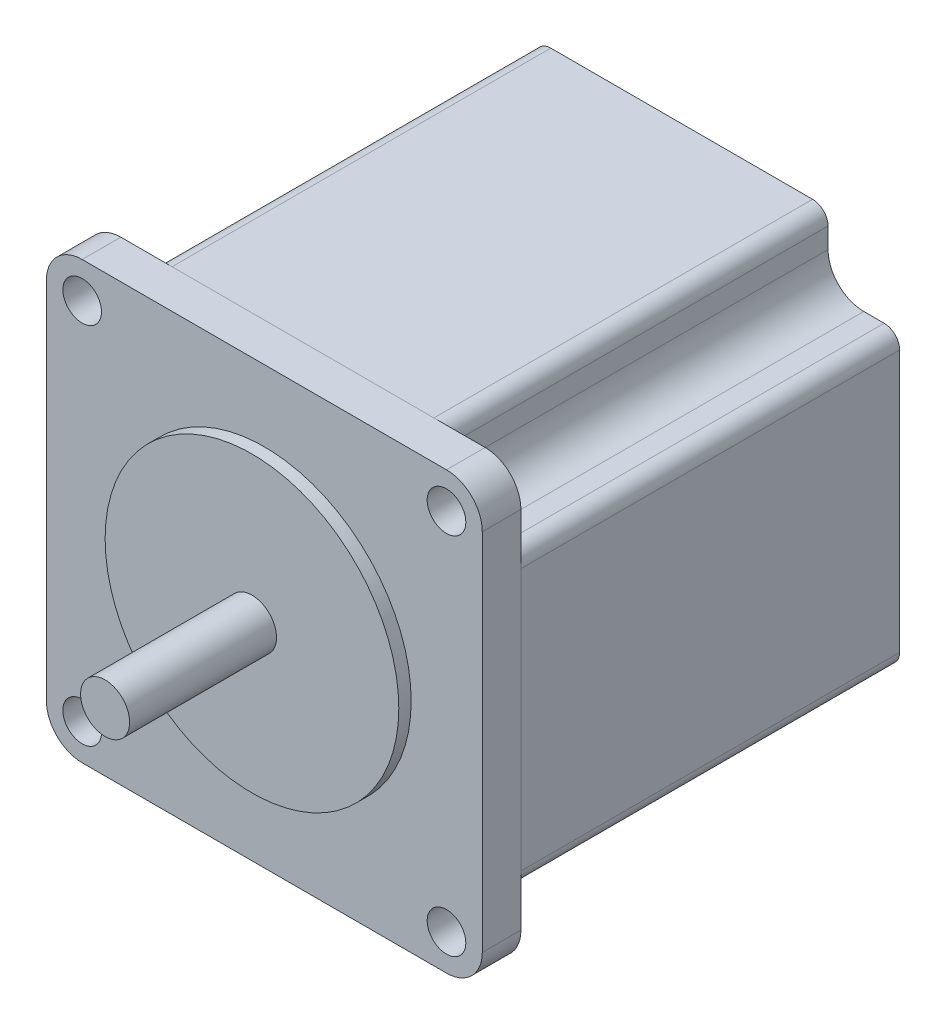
ISO-10303-21;
HEADER;
FILE_DESCRIPTION(('STEP AP214'),'2;1');
FILE_NAME('part.step','',(''),(''),'','','');
FILE_SCHEMA(('AUTOMOTIVE_DESIGN { 1 0 10303 214 1 1 1 1 }'));
ENDSEC;
DATA;
#1=APPLICATION_CONTEXT('core data for automotive mechanical design processes');
#2=APPLICATION_PROTOCOL_DEFINITION('international standard','automotive_design',2000,#1);
#3=PRODUCT_CONTEXT('',#1,'mechanical');
#4=PRODUCT('Part','Part','',(#3));
#5=PRODUCT_RELATED_PRODUCT_CATEGORY('part','',(#4));
#6=PRODUCT_DEFINITION_FORMATION('','',#4);
#7=PRODUCT_DEFINITION_CONTEXT('part definition',#1,'design');
#8=PRODUCT_DEFINITION('design','',#6,#7);
#9=PRODUCT_DEFINITION_SHAPE('','',#8);
#10=(LENGTH_UNIT() NAMED_UNIT(*) SI_UNIT(.MILLI.,.METRE.));
#11=(NAMED_UNIT(*) PLANE_ANGLE_UNIT() SI_UNIT($,.RADIAN.));
#12=(NAMED_UNIT(*) SI_UNIT($,.STERADIAN.) SOLID_ANGLE_UNIT());
#13=UNCERTAINTY_MEASURE_WITH_UNIT(LENGTH_MEASURE(1.E-05),#10,'distance_accuracy_value','');
#14=(GEOMETRIC_REPRESENTATION_CONTEXT(3) GLOBAL_UNCERTAINTY_ASSIGNED_CONTEXT((#13)) GLOBAL_UNIT_ASSIGNED_CONTEXT((#10,
#11,#12)) REPRESENTATION_CONTEXT('',''));
#15=CARTESIAN_POINT('',(0.,0.,0.));
#16=DIRECTION('',(0.,0.,1.));
#17=DIRECTION('',(1.,0.,0.));
#18=AXIS2_PLACEMENT_3D('',#15,#16,#17);
#19=CARTESIAN_POINT('',(26.2,-16.94,-54.));
#20=DIRECTION('',(0.,0.,1.));
#21=DIRECTION('',(1.,0.,0.));
#22=AXIS2_PLACEMENT_3D('',#19,#20,#21);
#23=CYLINDRICAL_SURFACE('',#22,2.);
#24=CARTESIAN_POINT('',(26.2,-16.94,-5.));
#25=DIRECTION('',(0.,0.,-1.));
#26=DIRECTION('',(-1.,0.,0.));
#27=AXIS2_PLACEMENT_3D('',#24,#25,#26);
#28=CIRCLE('',#27,2.);
#29=CARTESIAN_POINT('',(28.2,-16.94,-5.));
#30=VERTEX_POINT('',#29);
#31=CARTESIAN_POINT('',(26.2,-18.94,-5.));
#32=VERTEX_POINT('',#31);
#33=EDGE_CURVE('E238',#30,#32,#28,.T.);
#34=ORIENTED_EDGE('',*,*,#33,.T.);
#35=DIRECTION('',(0.,0.,1.));
#36=VECTOR('',#35,1.);
#37=CARTESIAN_POINT('',(26.2,-18.94,-54.));
#38=LINE('',#37,#36);
#39=CARTESIAN_POINT('',(26.2,-18.94,-54.));
#40=VERTEX_POINT('',#39);
#41=EDGE_CURVE('E12',#40,#32,#38,.T.);
#42=ORIENTED_EDGE('',*,*,#41,.F.);
#43=CARTESIAN_POINT('',(26.2,-16.94,-54.));
#44=DIRECTION('',(0.,0.,-1.));
#45=DIRECTION('',(-1.,0.,0.));
#46=AXIS2_PLACEMENT_3D('',#43,#44,#45);
#47=CIRCLE('',#46,2.);
#48=CARTESIAN_POINT('',(28.2,-16.94,-54.));
#49=VERTEX_POINT('',#48);
#50=EDGE_CURVE('E284',#49,#40,#47,.T.);
#51=ORIENTED_EDGE('',*,*,#50,.F.);
#52=DIRECTION('',(0.,0.,1.));
#53=VECTOR('',#52,1.);
#54=CARTESIAN_POINT('',(28.2,-16.94,-54.));
#55=LINE('',#54,#53);
#56=EDGE_CURVE('E234',#49,#30,#55,.T.);
#57=ORIENTED_EDGE('',*,*,#56,.T.);
#58=EDGE_LOOP('',(#34,#42,#51,#57));
#59=FACE_BOUND('',#58,.T.);
#60=ADVANCED_FACE('F46',(#59),#23,.T.);
#61=CARTESIAN_POINT('',(26.2,-18.94,-54.));
#62=DIRECTION('',(0.,1.,0.));
#63=DIRECTION('',(-1.,0.,0.));
#64=AXIS2_PLACEMENT_3D('',#61,#62,#63);
#65=PLANE('',#64);
#66=DIRECTION('',(-1.,0.,0.));
#67=VECTOR('',#66,1.);
#68=CARTESIAN_POINT('',(26.2,-18.94,-5.));
#69=LINE('',#68,#67);
#70=CARTESIAN_POINT('',(23.57,-18.94,-5.));
#71=VERTEX_POINT('',#70);
#72=EDGE_CURVE('E241',#32,#71,#69,.T.);
#73=ORIENTED_EDGE('',*,*,#72,.T.);
#74=DIRECTION('',(0.,0.,1.));
#75=VECTOR('',#74,1.);
#76=CARTESIAN_POINT('',(23.57,-18.94,-54.));
#77=LINE('',#76,#75);
#78=CARTESIAN_POINT('',(23.57,-18.94,-54.));
#79=VERTEX_POINT('',#78);
#80=EDGE_CURVE('E54',#79,#71,#77,.T.);
#81=ORIENTED_EDGE('',*,*,#80,.F.);
#82=DIRECTION('',(-1.,0.,0.));
#83=VECTOR('',#82,1.);
#84=CARTESIAN_POINT('',(26.2,-18.94,-54.));
#85=LINE('',#84,#83);
#86=EDGE_CURVE('E153',#40,#79,#85,.T.);
#87=ORIENTED_EDGE('',*,*,#86,.F.);
#88=ORIENTED_EDGE('',*,*,#41,.T.);
#89=EDGE_LOOP('',(#73,#81,#87,#88));
#90=FACE_BOUND('',#89,.T.);
#91=ADVANCED_FACE('F422',(#90),#65,.F.);
#92=CARTESIAN_POINT('',(23.57,-23.57,-54.));
#93=DIRECTION('',(0.,0.,1.));
#94=DIRECTION('',(1.,0.,0.));
#95=AXIS2_PLACEMENT_3D('',#92,#93,#94);
#96=CYLINDRICAL_SURFACE('',#95,4.62999999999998);
#97=CARTESIAN_POINT('',(23.57,-23.57,-5.));
#98=DIRECTION('',(0.,0.,1.));
#99=DIRECTION('',(-1.,0.,0.));
#100=AXIS2_PLACEMENT_3D('',#97,#98,#99);
#101=CIRCLE('',#100,4.62999999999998);
#102=CARTESIAN_POINT('',(18.94,-23.57,-5.));
#103=VERTEX_POINT('',#102);
#104=EDGE_CURVE('E243',#71,#103,#101,.T.);
#105=ORIENTED_EDGE('',*,*,#104,.T.);
#106=DIRECTION('',(0.,0.,1.));
#107=VECTOR('',#106,1.);
#108=CARTESIAN_POINT('',(18.94,-23.57,-54.));
#109=LINE('',#108,#107);
#110=CARTESIAN_POINT('',(18.94,-23.57,-54.));
#111=VERTEX_POINT('',#110);
#112=EDGE_CURVE('E339',#111,#103,#109,.T.);
#113=ORIENTED_EDGE('',*,*,#112,.F.);
#114=CARTESIAN_POINT('',(23.57,-23.57,-54.));
#115=DIRECTION('',(0.,0.,1.));
#116=DIRECTION('',(-1.,0.,0.));
#117=AXIS2_PLACEMENT_3D('',#114,#115,#116);
#118=CIRCLE('',#117,4.62999999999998);
#119=EDGE_CURVE('E347',#79,#111,#118,.T.);
#120=ORIENTED_EDGE('',*,*,#119,.F.);
#121=ORIENTED_EDGE('',*,*,#80,.T.);
#122=EDGE_LOOP('',(#105,#113,#120,#121));
#123=FACE_BOUND('',#122,.T.);
#124=ADVANCED_FACE('F345',(#123),#96,.F.);
#125=CARTESIAN_POINT('',(18.94,-23.57,-54.));
#126=DIRECTION('',(-1.,0.,0.));
#127=DIRECTION('',(0.,-1.,0.));
#128=AXIS2_PLACEMENT_3D('',#125,#126,#127);
#129=PLANE('',#128);
#130=DIRECTION('',(0.,-1.,0.));
#131=VECTOR('',#130,1.);
#132=CARTESIAN_POINT('',(18.94,-23.57,-5.));
#133=LINE('',#132,#131);
#134=CARTESIAN_POINT('',(18.94,-26.2,-5.));
#135=VERTEX_POINT('',#134);
#136=EDGE_CURVE('E245',#103,#135,#133,.T.);
#137=ORIENTED_EDGE('',*,*,#136,.T.);
#138=DIRECTION('',(0.,0.,1.));
#139=VECTOR('',#138,1.);
#140=CARTESIAN_POINT('',(18.94,-26.2,-54.));
#141=LINE('',#140,#139);
#142=CARTESIAN_POINT('',(18.94,-26.2,-54.));
#143=VERTEX_POINT('',#142);
#144=EDGE_CURVE('E336',#143,#135,#141,.T.);
#145=ORIENTED_EDGE('',*,*,#144,.F.);
#146=DIRECTION('',(0.,-1.,0.));
#147=VECTOR('',#146,1.);
#148=CARTESIAN_POINT('',(18.94,-23.57,-54.));
#149=LINE('',#148,#147);
#150=EDGE_CURVE('E365',#111,#143,#149,.T.);
#151=ORIENTED_EDGE('',*,*,#150,.F.);
#152=ORIENTED_EDGE('',*,*,#112,.T.);
#153=EDGE_LOOP('',(#137,#145,#151,#152));
#154=FACE_BOUND('',#153,.T.);
#155=ADVANCED_FACE('F356',(#154),#129,.F.);
#156=CARTESIAN_POINT('',(16.94,-26.2,-54.));
#157=DIRECTION('',(0.,0.,1.));
#158=DIRECTION('',(1.,0.,0.));
#159=AXIS2_PLACEMENT_3D('',#156,#157,#158);
#160=CYLINDRICAL_SURFACE('',#159,2.);
#161=CARTESIAN_POINT('',(16.94,-26.2,-5.));
#162=DIRECTION('',(0.,0.,-1.));
#163=DIRECTION('',(-1.,0.,0.));
#164=AXIS2_PLACEMENT_3D('',#161,#162,#163);
#165=CIRCLE('',#164,2.);
#166=CARTESIAN_POINT('',(16.94,-28.2,-5.));
#167=VERTEX_POINT('',#166);
#168=EDGE_CURVE('E247',#135,#167,#165,.T.);
#169=ORIENTED_EDGE('',*,*,#168,.T.);
#170=DIRECTION('',(0.,0.,1.));
#171=VECTOR('',#170,1.);
#172=CARTESIAN_POINT('',(16.94,-28.2,-54.));
#173=LINE('',#172,#171);
#174=CARTESIAN_POINT('',(16.94,-28.2,-54.));
#175=VERTEX_POINT('',#174);
#176=EDGE_CURVE('E333',#175,#167,#173,.T.);
#177=ORIENTED_EDGE('',*,*,#176,.F.);
#178=CARTESIAN_POINT('',(16.94,-26.2,-54.));
#179=DIRECTION('',(0.,0.,-1.));
#180=DIRECTION('',(-1.,0.,0.));
#181=AXIS2_PLACEMENT_3D('',#178,#179,#180);
#182=CIRCLE('',#181,2.);
#183=EDGE_CURVE('E362',#143,#175,#182,.T.);
#184=ORIENTED_EDGE('',*,*,#183,.F.);
#185=ORIENTED_EDGE('',*,*,#144,.T.);
#186=EDGE_LOOP('',(#169,#177,#184,#185));
#187=FACE_BOUND('',#186,.T.);
#188=ADVANCED_FACE('F360',(#187),#160,.T.);
#189=CARTESIAN_POINT('',(-16.94,-28.2,-54.));
#190=DIRECTION('',(0.,1.,0.));
#191=DIRECTION('',(-1.,0.,0.));
#192=AXIS2_PLACEMENT_3D('',#189,#190,#191);
#193=PLANE('',#192);
#194=DIRECTION('',(-1.,0.,0.));
#195=VECTOR('',#194,1.);
#196=CARTESIAN_POINT('',(-16.94,-28.2,-5.));
#197=LINE('',#196,#195);
#198=CARTESIAN_POINT('',(-16.94,-28.2,-5.));
#199=VERTEX_POINT('',#198);
#200=EDGE_CURVE('E249',#167,#199,#197,.T.);
#201=ORIENTED_EDGE('',*,*,#200,.T.);
#202=DIRECTION('',(0.,0.,1.));
#203=VECTOR('',#202,1.);
#204=CARTESIAN_POINT('',(-16.94,-28.2,-54.));
#205=LINE('',#204,#203);
#206=CARTESIAN_POINT('',(-16.94,-28.2,-54.));
#207=VERTEX_POINT('',#206);
#208=EDGE_CURVE('E330',#207,#199,#205,.T.);
#209=ORIENTED_EDGE('',*,*,#208,.F.);
#210=DIRECTION('',(-1.,0.,0.));
#211=VECTOR('',#210,1.);
#212=CARTESIAN_POINT('',(-16.94,-28.2,-54.));
#213=LINE('',#212,#211);
#214=EDGE_CURVE('E364',#175,#207,#213,.T.);
#215=ORIENTED_EDGE('',*,*,#214,.F.);
#216=ORIENTED_EDGE('',*,*,#176,.T.);
#217=EDGE_LOOP('',(#201,#209,#215,#216));
#218=FACE_BOUND('',#217,.T.);
#219=ADVANCED_FACE('F435',(#218),#193,.F.);
#220=CARTESIAN_POINT('',(-16.9400000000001,-26.2,-54.));
#221=DIRECTION('',(0.,0.,1.));
#222=DIRECTION('',(1.,0.,0.));
#223=AXIS2_PLACEMENT_3D('',#220,#221,#222);
#224=CYLINDRICAL_SURFACE('',#223,2.);
#225=CARTESIAN_POINT('',(-16.9400000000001,-26.2,-5.));
#226=DIRECTION('',(0.,0.,-1.));
#227=DIRECTION('',(-1.,0.,0.));
#228=AXIS2_PLACEMENT_3D('',#225,#226,#227);
#229=CIRCLE('',#228,2.);
#230=CARTESIAN_POINT('',(-18.9400000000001,-26.2,-5.));
#231=VERTEX_POINT('',#230);
#232=EDGE_CURVE('E251',#199,#231,#229,.T.);
#233=ORIENTED_EDGE('',*,*,#232,.T.);
#234=DIRECTION('',(0.,0.,1.));
#235=VECTOR('',#234,1.);
#236=CARTESIAN_POINT('',(-18.9400000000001,-26.2,-54.));
#237=LINE('',#236,#235);
#238=CARTESIAN_POINT('',(-18.9400000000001,-26.2,-54.));
#239=VERTEX_POINT('',#238);
#240=EDGE_CURVE('E327',#239,#231,#237,.T.);
#241=ORIENTED_EDGE('',*,*,#240,.F.);
#242=CARTESIAN_POINT('',(-16.9400000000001,-26.2,-54.));
#243=DIRECTION('',(0.,0.,-1.));
#244=DIRECTION('',(-1.,0.,0.));
#245=AXIS2_PLACEMENT_3D('',#242,#243,#244);
#246=CIRCLE('',#245,2.);
#247=EDGE_CURVE('E367',#207,#239,#246,.T.);
#248=ORIENTED_EDGE('',*,*,#247,.F.);
#249=ORIENTED_EDGE('',*,*,#208,.T.);
#250=EDGE_LOOP('',(#233,#241,#248,#249));
#251=FACE_BOUND('',#250,.T.);
#252=ADVANCED_FACE('F438',(#251),#224,.T.);
#253=CARTESIAN_POINT('',(-18.9400000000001,-23.57,-54.));
#254=DIRECTION('',(1.,0.,0.));
#255=DIRECTION('',(0.,1.,0.));
#256=AXIS2_PLACEMENT_3D('',#253,#254,#255);
#257=PLANE('',#256);
#258=DIRECTION('',(0.,1.,0.));
#259=VECTOR('',#258,1.);
#260=CARTESIAN_POINT('',(-18.9400000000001,-23.57,-5.));
#261=LINE('',#260,#259);
#262=CARTESIAN_POINT('',(-18.9400000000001,-23.57,-5.));
#263=VERTEX_POINT('',#262);
#264=EDGE_CURVE('E253',#231,#263,#261,.T.);
#265=ORIENTED_EDGE('',*,*,#264,.T.);
#266=DIRECTION('',(0.,0.,1.));
#267=VECTOR('',#266,1.);
#268=CARTESIAN_POINT('',(-18.9400000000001,-23.57,-54.));
#269=LINE('',#268,#267);
#270=CARTESIAN_POINT('',(-18.9400000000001,-23.57,-54.));
#271=VERTEX_POINT('',#270);
#272=EDGE_CURVE('E324',#271,#263,#269,.T.);
#273=ORIENTED_EDGE('',*,*,#272,.F.);
#274=DIRECTION('',(0.,1.,0.));
#275=VECTOR('',#274,1.);
#276=CARTESIAN_POINT('',(-18.9400000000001,-23.57,-54.));
#277=LINE('',#276,#275);
#278=EDGE_CURVE('E373',#239,#271,#277,.T.);
#279=ORIENTED_EDGE('',*,*,#278,.F.);
#280=ORIENTED_EDGE('',*,*,#240,.T.);
#281=EDGE_LOOP('',(#265,#273,#279,#280));
#282=FACE_BOUND('',#281,.T.);
#283=ADVANCED_FACE('F442',(#282),#257,.F.);
#284=CARTESIAN_POINT('',(-23.57,-23.57,-54.));
#285=DIRECTION('',(0.,0.,1.));
#286=DIRECTION('',(1.,0.,0.));
#287=AXIS2_PLACEMENT_3D('',#284,#285,#286);
#288=CYLINDRICAL_SURFACE('',#287,4.62999999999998);
#289=CARTESIAN_POINT('',(-23.57,-23.57,-5.));
#290=DIRECTION('',(0.,0.,1.));
#291=DIRECTION('',(-1.,0.,0.));
#292=AXIS2_PLACEMENT_3D('',#289,#290,#291);
#293=CIRCLE('',#292,4.62999999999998);
#294=CARTESIAN_POINT('',(-23.57,-18.94,-5.));
#295=VERTEX_POINT('',#294);
#296=EDGE_CURVE('E255',#263,#295,#293,.T.);
#297=ORIENTED_EDGE('',*,*,#296,.T.);
#298=DIRECTION('',(0.,0.,1.));
#299=VECTOR('',#298,1.);
#300=CARTESIAN_POINT('',(-23.57,-18.94,-54.));
#301=LINE('',#300,#299);
#302=CARTESIAN_POINT('',(-23.57,-18.94,-54.));
#303=VERTEX_POINT('',#302);
#304=EDGE_CURVE('E321',#303,#295,#301,.T.);
#305=ORIENTED_EDGE('',*,*,#304,.F.);
#306=CARTESIAN_POINT('',(-23.57,-23.57,-54.));
#307=DIRECTION('',(0.,0.,1.));
#308=DIRECTION('',(-1.,0.,0.));
#309=AXIS2_PLACEMENT_3D('',#306,#307,#308);
#310=CIRCLE('',#309,4.62999999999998);
#311=EDGE_CURVE('E375',#271,#303,#310,.T.);
#312=ORIENTED_EDGE('',*,*,#311,.F.);
#313=ORIENTED_EDGE('',*,*,#272,.T.);
#314=EDGE_LOOP('',(#297,#305,#312,#313));
#315=FACE_BOUND('',#314,.T.);
#316=ADVANCED_FACE('F446',(#315),#288,.F.);
#317=CARTESIAN_POINT('',(-23.57,-18.94,-54.));
#318=DIRECTION('',(0.,1.,0.));
#319=DIRECTION('',(-1.,0.,0.));
#320=AXIS2_PLACEMENT_3D('',#317,#318,#319);
#321=PLANE('',#320);
#322=DIRECTION('',(-1.,0.,0.));
#323=VECTOR('',#322,1.);
#324=CARTESIAN_POINT('',(-23.57,-18.94,-5.));
#325=LINE('',#324,#323);
#326=CARTESIAN_POINT('',(-26.2,-18.94,-5.));
#327=VERTEX_POINT('',#326);
#328=EDGE_CURVE('E257',#295,#327,#325,.T.);
#329=ORIENTED_EDGE('',*,*,#328,.T.);
#330=DIRECTION('',(0.,0.,1.));
#331=VECTOR('',#330,1.);
#332=CARTESIAN_POINT('',(-26.2,-18.94,-54.));
#333=LINE('',#332,#331);
#334=CARTESIAN_POINT('',(-26.2,-18.94,-54.));
#335=VERTEX_POINT('',#334);
#336=EDGE_CURVE('E318',#335,#327,#333,.T.);
#337=ORIENTED_EDGE('',*,*,#336,.F.);
#338=DIRECTION('',(-1.,0.,0.));
#339=VECTOR('',#338,1.);
#340=CARTESIAN_POINT('',(-23.57,-18.94,-54.));
#341=LINE('',#340,#339);
#342=EDGE_CURVE('E377',#303,#335,#341,.T.);
#343=ORIENTED_EDGE('',*,*,#342,.F.);
#344=ORIENTED_EDGE('',*,*,#304,.T.);
#345=EDGE_LOOP('',(#329,#337,#343,#344));
#346=FACE_BOUND('',#345,.T.);
#347=ADVANCED_FACE('F450',(#346),#321,.F.);
#348=CARTESIAN_POINT('',(-26.2,-16.94,-54.));
#349=DIRECTION('',(0.,0.,1.));
#350=DIRECTION('',(1.,0.,0.));
#351=AXIS2_PLACEMENT_3D('',#348,#349,#350);
#352=CYLINDRICAL_SURFACE('',#351,2.);
#353=CARTESIAN_POINT('',(-26.2,-16.94,-5.));
#354=DIRECTION('',(0.,0.,-1.));
#355=DIRECTION('',(1.,0.,0.));
#356=AXIS2_PLACEMENT_3D('',#353,#354,#355);
#357=CIRCLE('',#356,2.);
#358=CARTESIAN_POINT('',(-28.2,-16.94,-5.));
#359=VERTEX_POINT('',#358);
#360=EDGE_CURVE('E259',#327,#359,#357,.T.);
#361=ORIENTED_EDGE('',*,*,#360,.T.);
#362=DIRECTION('',(0.,0.,1.));
#363=VECTOR('',#362,1.);
#364=CARTESIAN_POINT('',(-28.2,-16.94,-54.));
#365=LINE('',#364,#363);
#366=CARTESIAN_POINT('',(-28.2,-16.94,-54.));
#367=VERTEX_POINT('',#366);
#368=EDGE_CURVE('E315',#367,#359,#365,.T.);
#369=ORIENTED_EDGE('',*,*,#368,.F.);
#370=CARTESIAN_POINT('',(-26.2,-16.94,-54.));
#371=DIRECTION('',(0.,0.,-1.));
#372=DIRECTION('',(1.,0.,0.));
#373=AXIS2_PLACEMENT_3D('',#370,#371,#372);
#374=CIRCLE('',#373,2.);
#375=EDGE_CURVE('E379',#335,#367,#374,.T.);
#376=ORIENTED_EDGE('',*,*,#375,.F.);
#377=ORIENTED_EDGE('',*,*,#336,.T.);
#378=EDGE_LOOP('',(#361,#369,#376,#377));
#379=FACE_BOUND('',#378,.T.);
#380=ADVANCED_FACE('F454',(#379),#352,.T.);
#381=CARTESIAN_POINT('',(-28.2,-16.94,-54.));
#382=DIRECTION('',(1.,0.,0.));
#383=DIRECTION('',(0.,1.,0.));
#384=AXIS2_PLACEMENT_3D('',#381,#382,#383);
#385=PLANE('',#384);
#386=DIRECTION('',(0.,1.,0.));
#387=VECTOR('',#386,1.);
#388=CARTESIAN_POINT('',(-28.2,-16.94,-5.));
#389=LINE('',#388,#387);
#390=CARTESIAN_POINT('',(-28.2,16.94,-5.));
#391=VERTEX_POINT('',#390);
#392=EDGE_CURVE('E261',#359,#391,#389,.T.);
#393=ORIENTED_EDGE('',*,*,#392,.T.);
#394=DIRECTION('',(0.,0.,1.));
#395=VECTOR('',#394,1.);
#396=CARTESIAN_POINT('',(-28.2,16.94,-54.));
#397=LINE('',#396,#395);
#398=CARTESIAN_POINT('',(-28.2,16.94,-54.));
#399=VERTEX_POINT('',#398);
#400=EDGE_CURVE('E312',#399,#391,#397,.T.);
#401=ORIENTED_EDGE('',*,*,#400,.F.);
#402=DIRECTION('',(0.,1.,0.));
#403=VECTOR('',#402,1.);
#404=CARTESIAN_POINT('',(-28.2,-16.94,-54.));
#405=LINE('',#404,#403);
#406=EDGE_CURVE('E381',#367,#399,#405,.T.);
#407=ORIENTED_EDGE('',*,*,#406,.F.);
#408=ORIENTED_EDGE('',*,*,#368,.T.);
#409=EDGE_LOOP('',(#393,#401,#407,#408));
#410=FACE_BOUND('',#409,.T.);
#411=ADVANCED_FACE('F458',(#410),#385,.F.);
#412=CARTESIAN_POINT('',(-26.2,16.94,-54.));
#413=DIRECTION('',(0.,0.,1.));
#414=DIRECTION('',(1.,0.,0.));
#415=AXIS2_PLACEMENT_3D('',#412,#413,#414);
#416=CYLINDRICAL_SURFACE('',#415,2.);
#417=CARTESIAN_POINT('',(-26.2,16.94,-5.));
#418=DIRECTION('',(0.,0.,-1.));
#419=DIRECTION('',(-1.,0.,0.));
#420=AXIS2_PLACEMENT_3D('',#417,#418,#419);
#421=CIRCLE('',#420,2.);
#422=CARTESIAN_POINT('',(-26.2,18.94,-5.));
#423=VERTEX_POINT('',#422);
#424=EDGE_CURVE('E263',#391,#423,#421,.T.);
#425=ORIENTED_EDGE('',*,*,#424,.T.);
#426=DIRECTION('',(0.,0.,1.));
#427=VECTOR('',#426,1.);
#428=CARTESIAN_POINT('',(-26.2,18.94,-54.));
#429=LINE('',#428,#427);
#430=CARTESIAN_POINT('',(-26.2,18.94,-54.));
#431=VERTEX_POINT('',#430);
#432=EDGE_CURVE('E309',#431,#423,#429,.T.);
#433=ORIENTED_EDGE('',*,*,#432,.F.);
#434=CARTESIAN_POINT('',(-26.2,16.94,-54.));
#435=DIRECTION('',(0.,0.,-1.));
#436=DIRECTION('',(-1.,0.,0.));
#437=AXIS2_PLACEMENT_3D('',#434,#435,#436);
#438=CIRCLE('',#437,2.);
#439=EDGE_CURVE('E383',#399,#431,#438,.T.);
#440=ORIENTED_EDGE('',*,*,#439,.F.);
#441=ORIENTED_EDGE('',*,*,#400,.T.);
#442=EDGE_LOOP('',(#425,#433,#440,#441));
#443=FACE_BOUND('',#442,.T.);
#444=ADVANCED_FACE('F462',(#443),#416,.T.);
#445=CARTESIAN_POINT('',(-26.2,18.94,-54.));
#446=DIRECTION('',(0.,-1.,0.));
#447=DIRECTION('',(1.,0.,0.));
#448=AXIS2_PLACEMENT_3D('',#445,#446,#447);
#449=PLANE('',#448);
#450=DIRECTION('',(1.,0.,0.));
#451=VECTOR('',#450,1.);
#452=CARTESIAN_POINT('',(-26.2,18.94,-5.));
#453=LINE('',#452,#451);
#454=CARTESIAN_POINT('',(-23.57,18.94,-5.));
#455=VERTEX_POINT('',#454);
#456=EDGE_CURVE('E265',#423,#455,#453,.T.);
#457=ORIENTED_EDGE('',*,*,#456,.T.);
#458=DIRECTION('',(0.,0.,1.));
#459=VECTOR('',#458,1.);
#460=CARTESIAN_POINT('',(-23.57,18.94,-54.));
#461=LINE('',#460,#459);
#462=CARTESIAN_POINT('',(-23.57,18.94,-54.));
#463=VERTEX_POINT('',#462);
#464=EDGE_CURVE('E306',#463,#455,#461,.T.);
#465=ORIENTED_EDGE('',*,*,#464,.F.);
#466=DIRECTION('',(1.,0.,0.));
#467=VECTOR('',#466,1.);
#468=CARTESIAN_POINT('',(-26.2,18.94,-54.));
#469=LINE('',#468,#467);
#470=EDGE_CURVE('E385',#431,#463,#469,.T.);
#471=ORIENTED_EDGE('',*,*,#470,.F.);
#472=ORIENTED_EDGE('',*,*,#432,.T.);
#473=EDGE_LOOP('',(#457,#465,#471,#472));
#474=FACE_BOUND('',#473,.T.);
#475=ADVANCED_FACE('F466',(#474),#449,.F.);
#476=CARTESIAN_POINT('',(-23.57,23.57,-54.));
#477=DIRECTION('',(0.,0.,1.));
#478=DIRECTION('',(1.,0.,0.));
#479=AXIS2_PLACEMENT_3D('',#476,#477,#478);
#480=CYLINDRICAL_SURFACE('',#479,4.63);
#481=CARTESIAN_POINT('',(-23.57,23.57,-5.));
#482=DIRECTION('',(0.,0.,1.));
#483=DIRECTION('',(-1.,0.,0.));
#484=AXIS2_PLACEMENT_3D('',#481,#482,#483);
#485=CIRCLE('',#484,4.63);
#486=CARTESIAN_POINT('',(-18.94,23.57,-5.));
#487=VERTEX_POINT('',#486);
#488=EDGE_CURVE('E267',#455,#487,#485,.T.);
#489=ORIENTED_EDGE('',*,*,#488,.T.);
#490=DIRECTION('',(0.,0.,1.));
#491=VECTOR('',#490,1.);
#492=CARTESIAN_POINT('',(-18.94,23.57,-54.));
#493=LINE('',#492,#491);
#494=CARTESIAN_POINT('',(-18.94,23.57,-54.));
#495=VERTEX_POINT('',#494);
#496=EDGE_CURVE('E303',#495,#487,#493,.T.);
#497=ORIENTED_EDGE('',*,*,#496,.F.);
#498=CARTESIAN_POINT('',(-23.57,23.57,-54.));
#499=DIRECTION('',(0.,0.,1.));
#500=DIRECTION('',(-1.,0.,0.));
#501=AXIS2_PLACEMENT_3D('',#498,#499,#500);
#502=CIRCLE('',#501,4.63);
#503=EDGE_CURVE('E387',#463,#495,#502,.T.);
#504=ORIENTED_EDGE('',*,*,#503,.F.);
#505=ORIENTED_EDGE('',*,*,#464,.T.);
#506=EDGE_LOOP('',(#489,#497,#504,#505));
#507=FACE_BOUND('',#506,.T.);
#508=ADVANCED_FACE('F470',(#507),#480,.F.);
#509=CARTESIAN_POINT('',(-18.9400000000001,26.2,-54.));
#510=DIRECTION('',(1.,0.,0.));
#511=DIRECTION('',(0.,1.,0.));
#512=AXIS2_PLACEMENT_3D('',#509,#510,#511);
#513=PLANE('',#512);
#514=DIRECTION('',(0.,1.,0.));
#515=VECTOR('',#514,1.);
#516=CARTESIAN_POINT('',(-18.9400000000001,26.2,-5.));
#517=LINE('',#516,#515);
#518=CARTESIAN_POINT('',(-18.94,26.2,-5.));
#519=VERTEX_POINT('',#518);
#520=EDGE_CURVE('E269',#487,#519,#517,.T.);
#521=ORIENTED_EDGE('',*,*,#520,.T.);
#522=DIRECTION('',(0.,0.,1.));
#523=VECTOR('',#522,1.);
#524=CARTESIAN_POINT('',(-18.94,26.2,-54.));
#525=LINE('',#524,#523);
#526=CARTESIAN_POINT('',(-18.94,26.2,-54.));
#527=VERTEX_POINT('',#526);
#528=EDGE_CURVE('E300',#527,#519,#525,.T.);
#529=ORIENTED_EDGE('',*,*,#528,.F.);
#530=DIRECTION('',(0.,1.,0.));
#531=VECTOR('',#530,1.);
#532=CARTESIAN_POINT('',(-18.9400000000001,26.2,-54.));
#533=LINE('',#532,#531);
#534=EDGE_CURVE('E389',#495,#527,#533,.T.);
#535=ORIENTED_EDGE('',*,*,#534,.F.);
#536=ORIENTED_EDGE('',*,*,#496,.T.);
#537=EDGE_LOOP('',(#521,#529,#535,#536));
#538=FACE_BOUND('',#537,.T.);
#539=ADVANCED_FACE('F474',(#538),#513,.F.);
#540=CARTESIAN_POINT('',(-16.94,26.2,-54.));
#541=DIRECTION('',(0.,0.,1.));
#542=DIRECTION('',(1.,0.,0.));
#543=AXIS2_PLACEMENT_3D('',#540,#541,#542);
#544=CYLINDRICAL_SURFACE('',#543,2.);
#545=CARTESIAN_POINT('',(-16.94,26.2,-5.));
#546=DIRECTION('',(0.,0.,-1.));
#547=DIRECTION('',(-1.,0.,0.));
#548=AXIS2_PLACEMENT_3D('',#545,#546,#547);
#549=CIRCLE('',#548,2.);
#550=CARTESIAN_POINT('',(-16.94,28.2,-5.));
#551=VERTEX_POINT('',#550);
#552=EDGE_CURVE('E271',#519,#551,#549,.T.);
#553=ORIENTED_EDGE('',*,*,#552,.T.);
#554=DIRECTION('',(0.,0.,1.));
#555=VECTOR('',#554,1.);
#556=CARTESIAN_POINT('',(-16.94,28.2,-54.));
#557=LINE('',#556,#555);
#558=CARTESIAN_POINT('',(-16.94,28.2,-54.));
#559=VERTEX_POINT('',#558);
#560=EDGE_CURVE('E297',#559,#551,#557,.T.);
#561=ORIENTED_EDGE('',*,*,#560,.F.);
#562=CARTESIAN_POINT('',(-16.94,26.2,-54.));
#563=DIRECTION('',(0.,0.,-1.));
#564=DIRECTION('',(-1.,0.,0.));
#565=AXIS2_PLACEMENT_3D('',#562,#563,#564);
#566=CIRCLE('',#565,2.);
#567=EDGE_CURVE('E391',#527,#559,#566,.T.);
#568=ORIENTED_EDGE('',*,*,#567,.F.);
#569=ORIENTED_EDGE('',*,*,#528,.T.);
#570=EDGE_LOOP('',(#553,#561,#568,#569));
#571=FACE_BOUND('',#570,.T.);
#572=ADVANCED_FACE('F478',(#571),#544,.T.);
#573=CARTESIAN_POINT('',(16.94,28.2,-54.));
#574=DIRECTION('',(0.,-1.,0.));
#575=DIRECTION('',(0.,0.,-1.));
#576=AXIS2_PLACEMENT_3D('',#573,#574,#575);
#577=PLANE('',#576);
#578=DIRECTION('',(1.,0.,0.));
#579=VECTOR('',#578,1.);
#580=CARTESIAN_POINT('',(16.94,28.2,-5.));
#581=LINE('',#580,#579);
#582=CARTESIAN_POINT('',(16.94,28.2,-5.));
#583=VERTEX_POINT('',#582);
#584=EDGE_CURVE('E273',#551,#583,#581,.T.);
#585=ORIENTED_EDGE('',*,*,#584,.T.);
#586=DIRECTION('',(0.,0.,1.));
#587=VECTOR('',#586,1.);
#588=CARTESIAN_POINT('',(16.94,28.2,-54.));
#589=LINE('',#588,#587);
#590=CARTESIAN_POINT('',(16.94,28.2,-54.));
#591=VERTEX_POINT('',#590);
#592=EDGE_CURVE('E294',#591,#583,#589,.T.);
#593=ORIENTED_EDGE('',*,*,#592,.F.);
#594=DIRECTION('',(1.,0.,0.));
#595=VECTOR('',#594,1.);
#596=CARTESIAN_POINT('',(16.94,28.2,-54.));
#597=LINE('',#596,#595);
#598=EDGE_CURVE('E393',#559,#591,#597,.T.);
#599=ORIENTED_EDGE('',*,*,#598,.F.);
#600=ORIENTED_EDGE('',*,*,#560,.T.);
#601=EDGE_LOOP('',(#585,#593,#599,#600));
#602=FACE_BOUND('',#601,.T.);
#603=ADVANCED_FACE('F482',(#602),#577,.F.);
#604=CARTESIAN_POINT('',(16.94,26.2,-54.));
#605=DIRECTION('',(0.,0.,1.));
#606=DIRECTION('',(1.,0.,0.));
#607=AXIS2_PLACEMENT_3D('',#604,#605,#606);
#608=CYLINDRICAL_SURFACE('',#607,2.);
#609=CARTESIAN_POINT('',(16.94,26.2,-5.));
#610=DIRECTION('',(0.,0.,-1.));
#611=DIRECTION('',(-1.,0.,0.));
#612=AXIS2_PLACEMENT_3D('',#609,#610,#611);
#613=CIRCLE('',#612,2.);
#614=CARTESIAN_POINT('',(18.94,26.2,-5.));
#615=VERTEX_POINT('',#614);
#616=EDGE_CURVE('E275',#583,#615,#613,.T.);
#617=ORIENTED_EDGE('',*,*,#616,.T.);
#618=DIRECTION('',(0.,0.,1.));
#619=VECTOR('',#618,1.);
#620=CARTESIAN_POINT('',(18.94,26.2,-54.));
#621=LINE('',#620,#619);
#622=CARTESIAN_POINT('',(18.94,26.2,-54.));
#623=VERTEX_POINT('',#622);
#624=EDGE_CURVE('E291',#623,#615,#621,.T.);
#625=ORIENTED_EDGE('',*,*,#624,.F.);
#626=CARTESIAN_POINT('',(16.94,26.2,-54.));
#627=DIRECTION('',(0.,0.,-1.));
#628=DIRECTION('',(-1.,0.,0.));
#629=AXIS2_PLACEMENT_3D('',#626,#627,#628);
#630=CIRCLE('',#629,2.);
#631=EDGE_CURVE('E395',#591,#623,#630,.T.);
#632=ORIENTED_EDGE('',*,*,#631,.F.);
#633=ORIENTED_EDGE('',*,*,#592,.T.);
#634=EDGE_LOOP('',(#617,#625,#632,#633));
#635=FACE_BOUND('',#634,.T.);
#636=ADVANCED_FACE('F486',(#635),#608,.T.);
#637=CARTESIAN_POINT('',(18.94,23.57,-54.));
#638=DIRECTION('',(-1.,0.,0.));
#639=DIRECTION('',(0.,-1.,0.));
#640=AXIS2_PLACEMENT_3D('',#637,#638,#639);
#641=PLANE('',#640);
#642=DIRECTION('',(0.,-1.,0.));
#643=VECTOR('',#642,1.);
#644=CARTESIAN_POINT('',(18.94,23.57,-5.));
#645=LINE('',#644,#643);
#646=CARTESIAN_POINT('',(18.94,23.57,-5.));
#647=VERTEX_POINT('',#646);
#648=EDGE_CURVE('E277',#615,#647,#645,.T.);
#649=ORIENTED_EDGE('',*,*,#648,.T.);
#650=DIRECTION('',(0.,0.,1.));
#651=VECTOR('',#650,1.);
#652=CARTESIAN_POINT('',(18.94,23.57,-54.));
#653=LINE('',#652,#651);
#654=CARTESIAN_POINT('',(18.94,23.57,-54.));
#655=VERTEX_POINT('',#654);
#656=EDGE_CURVE('E288',#655,#647,#653,.T.);
#657=ORIENTED_EDGE('',*,*,#656,.F.);
#658=DIRECTION('',(0.,-1.,0.));
#659=VECTOR('',#658,1.);
#660=CARTESIAN_POINT('',(18.94,23.57,-54.));
#661=LINE('',#660,#659);
#662=EDGE_CURVE('E397',#623,#655,#661,.T.);
#663=ORIENTED_EDGE('',*,*,#662,.F.);
#664=ORIENTED_EDGE('',*,*,#624,.T.);
#665=EDGE_LOOP('',(#649,#657,#663,#664));
#666=FACE_BOUND('',#665,.T.);
#667=ADVANCED_FACE('F403',(#666),#641,.F.);
#668=CARTESIAN_POINT('',(23.57,23.57,-54.));
#669=DIRECTION('',(0.,0.,1.));
#670=DIRECTION('',(1.,0.,0.));
#671=AXIS2_PLACEMENT_3D('',#668,#669,#670);
#672=CYLINDRICAL_SURFACE('',#671,4.62999999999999);
#673=CARTESIAN_POINT('',(23.57,23.57,-5.));
#674=DIRECTION('',(0.,0.,1.));
#675=DIRECTION('',(-1.,0.,0.));
#676=AXIS2_PLACEMENT_3D('',#673,#674,#675);
#677=CIRCLE('',#676,4.62999999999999);
#678=CARTESIAN_POINT('',(23.57,18.94,-5.));
#679=VERTEX_POINT('',#678);
#680=EDGE_CURVE('E279',#647,#679,#677,.T.);
#681=ORIENTED_EDGE('',*,*,#680,.T.);
#682=DIRECTION('',(0.,0.,1.));
#683=VECTOR('',#682,1.);
#684=CARTESIAN_POINT('',(23.57,18.94,-54.));
#685=LINE('',#684,#683);
#686=CARTESIAN_POINT('',(23.57,18.94,-54.));
#687=VERTEX_POINT('',#686);
#688=EDGE_CURVE('E229',#687,#679,#685,.T.);
#689=ORIENTED_EDGE('',*,*,#688,.F.);
#690=CARTESIAN_POINT('',(23.57,23.57,-54.));
#691=DIRECTION('',(0.,0.,1.));
#692=DIRECTION('',(-1.,0.,0.));
#693=AXIS2_PLACEMENT_3D('',#690,#691,#692);
#694=CIRCLE('',#693,4.62999999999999);
#695=EDGE_CURVE('E220',#655,#687,#694,.T.);
#696=ORIENTED_EDGE('',*,*,#695,.F.);
#697=ORIENTED_EDGE('',*,*,#656,.T.);
#698=EDGE_LOOP('',(#681,#689,#696,#697));
#699=FACE_BOUND('',#698,.T.);
#700=ADVANCED_FACE('F407',(#699),#672,.F.);
#701=CARTESIAN_POINT('',(23.57,18.94,-54.));
#702=DIRECTION('',(0.,-1.,0.));
#703=DIRECTION('',(1.,0.,0.));
#704=AXIS2_PLACEMENT_3D('',#701,#702,#703);
#705=PLANE('',#704);
#706=DIRECTION('',(1.,0.,0.));
#707=VECTOR('',#706,1.);
#708=CARTESIAN_POINT('',(23.57,18.94,-5.));
#709=LINE('',#708,#707);
#710=CARTESIAN_POINT('',(26.2,18.94,-5.));
#711=VERTEX_POINT('',#710);
#712=EDGE_CURVE('E228',#679,#711,#709,.T.);
#713=ORIENTED_EDGE('',*,*,#712,.T.);
#714=DIRECTION('',(0.,0.,1.));
#715=VECTOR('',#714,1.);
#716=CARTESIAN_POINT('',(26.2,18.94,-54.));
#717=LINE('',#716,#715);
#718=CARTESIAN_POINT('',(26.2,18.94,-54.));
#719=VERTEX_POINT('',#718);
#720=EDGE_CURVE('E225',#719,#711,#717,.T.);
#721=ORIENTED_EDGE('',*,*,#720,.F.);
#722=DIRECTION('',(1.,0.,0.));
#723=VECTOR('',#722,1.);
#724=CARTESIAN_POINT('',(23.57,18.94,-54.));
#725=LINE('',#724,#723);
#726=EDGE_CURVE('E214',#687,#719,#725,.T.);
#727=ORIENTED_EDGE('',*,*,#726,.F.);
#728=ORIENTED_EDGE('',*,*,#688,.T.);
#729=EDGE_LOOP('',(#713,#721,#727,#728));
#730=FACE_BOUND('',#729,.T.);
#731=ADVANCED_FACE('F226',(#730),#705,.F.);
#732=CARTESIAN_POINT('',(26.2,16.94,-54.));
#733=DIRECTION('',(0.,0.,1.));
#734=DIRECTION('',(1.,0.,0.));
#735=AXIS2_PLACEMENT_3D('',#732,#733,#734);
#736=CYLINDRICAL_SURFACE('',#735,2.);
#737=CARTESIAN_POINT('',(26.2,16.94,-5.));
#738=DIRECTION('',(0.,0.,-1.));
#739=DIRECTION('',(1.,0.,0.));
#740=AXIS2_PLACEMENT_3D('',#737,#738,#739);
#741=CIRCLE('',#740,2.);
#742=CARTESIAN_POINT('',(28.2,16.94,-5.));
#743=VERTEX_POINT('',#742);
#744=EDGE_CURVE('E139',#711,#743,#741,.T.);
#745=ORIENTED_EDGE('',*,*,#744,.T.);
#746=DIRECTION('',(0.,0.,1.));
#747=VECTOR('',#746,1.);
#748=CARTESIAN_POINT('',(28.2,16.94,-54.));
#749=LINE('',#748,#747);
#750=CARTESIAN_POINT('',(28.2,16.94,-54.));
#751=VERTEX_POINT('',#750);
#752=EDGE_CURVE('E230',#751,#743,#749,.T.);
#753=ORIENTED_EDGE('',*,*,#752,.F.);
#754=CARTESIAN_POINT('',(26.2,16.94,-54.));
#755=DIRECTION('',(0.,0.,-1.));
#756=DIRECTION('',(1.,0.,0.));
#757=AXIS2_PLACEMENT_3D('',#754,#755,#756);
#758=CIRCLE('',#757,2.);
#759=EDGE_CURVE('E218',#719,#751,#758,.T.);
#760=ORIENTED_EDGE('',*,*,#759,.F.);
#761=ORIENTED_EDGE('',*,*,#720,.T.);
#762=EDGE_LOOP('',(#745,#753,#760,#761));
#763=FACE_BOUND('',#762,.T.);
#764=ADVANCED_FACE('F232',(#763),#736,.T.);
#765=CARTESIAN_POINT('',(28.2,16.94,-54.));
#766=DIRECTION('',(-1.,0.,0.));
#767=DIRECTION('',(0.,0.,1.));
#768=AXIS2_PLACEMENT_3D('',#765,#766,#767);
#769=PLANE('',#768);
#770=DIRECTION('',(0.,-1.,0.));
#771=VECTOR('',#770,1.);
#772=CARTESIAN_POINT('',(28.2,16.94,-5.));
#773=LINE('',#772,#771);
#774=EDGE_CURVE('E145',#743,#30,#773,.T.);
#775=ORIENTED_EDGE('',*,*,#774,.T.);
#776=ORIENTED_EDGE('',*,*,#56,.F.);
#777=DIRECTION('',(0.,-1.,0.));
#778=VECTOR('',#777,1.);
#779=CARTESIAN_POINT('',(28.2,16.94,-54.));
#780=LINE('',#779,#778);
#781=EDGE_CURVE('E62',#751,#49,#780,.T.);
#782=ORIENTED_EDGE('',*,*,#781,.F.);
#783=ORIENTED_EDGE('',*,*,#752,.T.);
#784=EDGE_LOOP('',(#775,#776,#782,#783));
#785=FACE_BOUND('',#784,.T.);
#786=ADVANCED_FACE('F411',(#785),#769,.F.);
#787=CARTESIAN_POINT('',(26.2,-16.94,-54.));
#788=DIRECTION('',(0.,0.,-1.));
#789=DIRECTION('',(-1.,0.,0.));
#790=AXIS2_PLACEMENT_3D('',#787,#788,#789);
#791=PLANE('',#790);
#792=ORIENTED_EDGE('',*,*,#50,.T.);
#793=ORIENTED_EDGE('',*,*,#86,.T.);
#794=ORIENTED_EDGE('',*,*,#119,.T.);
#795=ORIENTED_EDGE('',*,*,#150,.T.);
#796=ORIENTED_EDGE('',*,*,#183,.T.);
#797=ORIENTED_EDGE('',*,*,#214,.T.);
#798=ORIENTED_EDGE('',*,*,#247,.T.);
#799=ORIENTED_EDGE('',*,*,#278,.T.);
#800=ORIENTED_EDGE('',*,*,#311,.T.);
#801=ORIENTED_EDGE('',*,*,#342,.T.);
#802=ORIENTED_EDGE('',*,*,#375,.T.);
#803=ORIENTED_EDGE('',*,*,#406,.T.);
#804=ORIENTED_EDGE('',*,*,#439,.T.);
#805=ORIENTED_EDGE('',*,*,#470,.T.);
#806=ORIENTED_EDGE('',*,*,#503,.T.);
#807=ORIENTED_EDGE('',*,*,#534,.T.);
#808=ORIENTED_EDGE('',*,*,#567,.T.);
#809=ORIENTED_EDGE('',*,*,#598,.T.);
#810=ORIENTED_EDGE('',*,*,#631,.T.);
#811=ORIENTED_EDGE('',*,*,#662,.T.);
#812=ORIENTED_EDGE('',*,*,#695,.T.);
#813=ORIENTED_EDGE('',*,*,#726,.T.);
#814=ORIENTED_EDGE('',*,*,#759,.T.);
#815=ORIENTED_EDGE('',*,*,#781,.T.);
#816=EDGE_LOOP('',(#792,#793,#794,#795,#796,#797,#798,#799,#800,#801,#802,#803,#804,#805,#806,
#807,#808,#809,#810,#811,#812,#813,#814,#815));
#817=FACE_BOUND('',#816,.T.);
#818=ADVANCED_FACE('F216',(#817),#791,.T.);
#819=CARTESIAN_POINT('',(26.2,-16.94,-5.));
#820=DIRECTION('',(0.,0.,-1.));
#821=DIRECTION('',(-1.,0.,0.));
#822=AXIS2_PLACEMENT_3D('',#819,#820,#821);
#823=PLANE('',#822);
#824=ORIENTED_EDGE('',*,*,#33,.F.);
#825=ORIENTED_EDGE('',*,*,#774,.F.);
#826=ORIENTED_EDGE('',*,*,#744,.F.);
#827=ORIENTED_EDGE('',*,*,#712,.F.);
#828=ORIENTED_EDGE('',*,*,#680,.F.);
#829=ORIENTED_EDGE('',*,*,#648,.F.);
#830=ORIENTED_EDGE('',*,*,#616,.F.);
#831=ORIENTED_EDGE('',*,*,#584,.F.);
#832=ORIENTED_EDGE('',*,*,#552,.F.);
#833=ORIENTED_EDGE('',*,*,#520,.F.);
#834=ORIENTED_EDGE('',*,*,#488,.F.);
#835=ORIENTED_EDGE('',*,*,#456,.F.);
#836=ORIENTED_EDGE('',*,*,#424,.F.);
#837=ORIENTED_EDGE('',*,*,#392,.F.);
#838=ORIENTED_EDGE('',*,*,#360,.F.);
#839=ORIENTED_EDGE('',*,*,#328,.F.);
#840=ORIENTED_EDGE('',*,*,#296,.F.);
#841=ORIENTED_EDGE('',*,*,#264,.F.);
#842=ORIENTED_EDGE('',*,*,#232,.F.);
#843=ORIENTED_EDGE('',*,*,#200,.F.);
#844=ORIENTED_EDGE('',*,*,#168,.F.);
#845=ORIENTED_EDGE('',*,*,#136,.F.);
#846=ORIENTED_EDGE('',*,*,#104,.F.);
#847=ORIENTED_EDGE('',*,*,#72,.F.);
#848=EDGE_LOOP('',(#824,#825,#826,#827,#828,#829,#830,#831,#832,#833,#834,#835,#836,#837,#838,
#839,#840,#841,#842,#843,#844,#845,#846,#847));
#849=FACE_BOUND('',#848,.T.);
#850=ADVANCED_FACE('F351',(#849),#823,.F.);
#851=CLOSED_SHELL('',(#60,#91,#124,#155,#188,#219,#252,#283,#316,#347,#380,#411,#444,#475,#508,
#539,#572,#603,#636,#667,#700,#731,#764,#786,#818,#850));
#852=MANIFOLD_SOLID_BREP('B2',#851);
#853=CARTESIAN_POINT('',(0.,0.,1.6));
#854=DIRECTION('',(0.,0.,1.));
#855=DIRECTION('',(1.,0.,0.));
#856=AXIS2_PLACEMENT_3D('',#853,#854,#855);
#857=PLANE('',#856);
#858=CARTESIAN_POINT('',(0.,0.,1.6));
#859=DIRECTION('',(0.,0.,1.));
#860=DIRECTION('',(1.,0.,0.));
#861=AXIS2_PLACEMENT_3D('',#858,#859,#860);
#862=CIRCLE('',#861,19.);
#863=CARTESIAN_POINT('',(19.,0.,1.6));
#864=VERTEX_POINT('',#863);
#865=EDGE_CURVE('E997',#864,#864,#862,.T.);
#866=ORIENTED_EDGE('',*,*,#865,.T.);
#867=EDGE_LOOP('',(#866));
#868=FACE_BOUND('',#867,.T.);
#869=CARTESIAN_POINT('',(0.,0.,1.6));
#870=DIRECTION('',(0.,0.,1.));
#871=DIRECTION('',(1.,0.,0.));
#872=AXIS2_PLACEMENT_3D('',#869,#870,#871);
#873=CIRCLE('',#872,3.175);
#874=CARTESIAN_POINT('',(3.175,0.,1.6));
#875=VERTEX_POINT('',#874);
#876=EDGE_CURVE('E994',#875,#875,#873,.T.);
#877=ORIENTED_EDGE('',*,*,#876,.F.);
#878=EDGE_LOOP('',(#877));
#879=FACE_BOUND('',#878,.T.);
#880=ADVANCED_FACE('F691',(#868,#879),#857,.T.);
#881=CARTESIAN_POINT('',(23.57,23.57,0.));
#882=DIRECTION('',(0.,0.,1.));
#883=DIRECTION('',(1.,0.,0.));
#884=AXIS2_PLACEMENT_3D('',#881,#882,#883);
#885=PLANE('',#884);
#886=CARTESIAN_POINT('',(23.57,23.57,0.));
#887=DIRECTION('',(0.,0.,1.));
#888=DIRECTION('',(1.,0.,0.));
#889=AXIS2_PLACEMENT_3D('',#886,#887,#888);
#890=CIRCLE('',#889,4.62999999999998);
#891=CARTESIAN_POINT('',(28.2,23.57,0.));
#892=VERTEX_POINT('',#891);
#893=CARTESIAN_POINT('',(23.57,28.2,0.));
#894=VERTEX_POINT('',#893);
#895=EDGE_CURVE('E789',#892,#894,#890,.T.);
#896=ORIENTED_EDGE('',*,*,#895,.T.);
#897=DIRECTION('',(-1.,0.,0.));
#898=VECTOR('',#897,1.);
#899=CARTESIAN_POINT('',(23.57,28.2,0.));
#900=LINE('',#899,#898);
#901=CARTESIAN_POINT('',(-23.57,28.2,0.));
#902=VERTEX_POINT('',#901);
#903=EDGE_CURVE('E792',#894,#902,#900,.T.);
#904=ORIENTED_EDGE('',*,*,#903,.T.);
#905=CARTESIAN_POINT('',(-23.57,23.57,0.));
#906=DIRECTION('',(0.,0.,1.));
#907=DIRECTION('',(1.,0.,0.));
#908=AXIS2_PLACEMENT_3D('',#905,#906,#907);
#909=CIRCLE('',#908,4.62999999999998);
#910=CARTESIAN_POINT('',(-28.2,23.57,0.));
#911=VERTEX_POINT('',#910);
#912=EDGE_CURVE('E796',#902,#911,#909,.T.);
#913=ORIENTED_EDGE('',*,*,#912,.T.);
#914=DIRECTION('',(0.,-1.,0.));
#915=VECTOR('',#914,1.);
#916=CARTESIAN_POINT('',(-28.2,23.57,0.));
#917=LINE('',#916,#915);
#918=CARTESIAN_POINT('',(-28.2,-23.57,0.));
#919=VERTEX_POINT('',#918);
#920=EDGE_CURVE('E799',#911,#919,#917,.T.);
#921=ORIENTED_EDGE('',*,*,#920,.T.);
#922=CARTESIAN_POINT('',(-23.57,-23.57,0.));
#923=DIRECTION('',(0.,0.,1.));
#924=DIRECTION('',(1.,0.,0.));
#925=AXIS2_PLACEMENT_3D('',#922,#923,#924);
#926=CIRCLE('',#925,4.62999999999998);
#927=CARTESIAN_POINT('',(-23.57,-28.2,0.));
#928=VERTEX_POINT('',#927);
#929=EDGE_CURVE('E802',#919,#928,#926,.T.);
#930=ORIENTED_EDGE('',*,*,#929,.T.);
#931=DIRECTION('',(1.,0.,0.));
#932=VECTOR('',#931,1.);
#933=CARTESIAN_POINT('',(23.57,-28.2,0.));
#934=LINE('',#933,#932);
#935=CARTESIAN_POINT('',(23.57,-28.2,0.));
#936=VERTEX_POINT('',#935);
#937=EDGE_CURVE('E805',#928,#936,#934,.T.);
#938=ORIENTED_EDGE('',*,*,#937,.T.);
#939=CARTESIAN_POINT('',(23.57,-23.57,0.));
#940=DIRECTION('',(0.,0.,1.));
#941=DIRECTION('',(1.,0.,0.));
#942=AXIS2_PLACEMENT_3D('',#939,#940,#941);
#943=CIRCLE('',#942,4.62999999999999);
#944=CARTESIAN_POINT('',(28.2,-23.57,0.));
#945=VERTEX_POINT('',#944);
#946=EDGE_CURVE('E766',#936,#945,#943,.T.);
#947=ORIENTED_EDGE('',*,*,#946,.T.);
#948=DIRECTION('',(0.,1.,0.));
#949=VECTOR('',#948,1.);
#950=CARTESIAN_POINT('',(28.2,23.57,0.));
#951=LINE('',#950,#949);
#952=EDGE_CURVE('E808',#945,#892,#951,.T.);
#953=ORIENTED_EDGE('',*,*,#952,.T.);
#954=EDGE_LOOP('',(#896,#904,#913,#921,#930,#938,#947,#953));
#955=FACE_BOUND('',#954,.T.);
#956=CARTESIAN_POINT('',(-23.57,-23.57,0.));
#957=DIRECTION('',(0.,0.,1.));
#958=DIRECTION('',(1.,0.,0.));
#959=AXIS2_PLACEMENT_3D('',#956,#957,#958);
#960=CIRCLE('',#959,2.5);
#961=CARTESIAN_POINT('',(-21.07,-23.57,0.));
#962=VERTEX_POINT('',#961);
#963=EDGE_CURVE('E884',#962,#962,#960,.T.);
#964=ORIENTED_EDGE('',*,*,#963,.F.);
#965=EDGE_LOOP('',(#964));
#966=FACE_BOUND('',#965,.T.);
#967=CARTESIAN_POINT('',(-23.57,23.57,0.));
#968=DIRECTION('',(0.,0.,1.));
#969=DIRECTION('',(1.,0.,0.));
#970=AXIS2_PLACEMENT_3D('',#967,#968,#969);
#971=CIRCLE('',#970,2.5);
#972=CARTESIAN_POINT('',(-21.07,23.57,0.));
#973=VERTEX_POINT('',#972);
#974=EDGE_CURVE('E889',#973,#973,#971,.T.);
#975=ORIENTED_EDGE('',*,*,#974,.F.);
#976=EDGE_LOOP('',(#975));
#977=FACE_BOUND('',#976,.T.);
#978=CARTESIAN_POINT('',(23.57,23.57,0.));
#979=DIRECTION('',(0.,0.,1.));
#980=DIRECTION('',(1.,0.,0.));
#981=AXIS2_PLACEMENT_3D('',#978,#979,#980);
#982=CIRCLE('',#981,2.5);
#983=CARTESIAN_POINT('',(26.07,23.57,0.));
#984=VERTEX_POINT('',#983);
#985=EDGE_CURVE('E1005',#984,#984,#982,.T.);
#986=ORIENTED_EDGE('',*,*,#985,.F.);
#987=EDGE_LOOP('',(#986));
#988=FACE_BOUND('',#987,.T.);
#989=CARTESIAN_POINT('',(23.57,-23.57,0.));
#990=DIRECTION('',(0.,0.,1.));
#991=DIRECTION('',(1.,0.,0.));
#992=AXIS2_PLACEMENT_3D('',#989,#990,#991);
#993=CIRCLE('',#992,2.5);
#994=CARTESIAN_POINT('',(26.07,-23.57,0.));
#995=VERTEX_POINT('',#994);
#996=EDGE_CURVE('E1002',#995,#995,#993,.T.);
#997=ORIENTED_EDGE('',*,*,#996,.F.);
#998=EDGE_LOOP('',(#997));
#999=FACE_BOUND('',#998,.T.);
#1000=CARTESIAN_POINT('',(0.,0.,0.));
#1001=DIRECTION('',(0.,0.,1.));
#1002=DIRECTION('',(1.,0.,0.));
#1003=AXIS2_PLACEMENT_3D('',#1000,#1001,#1002);
#1004=CIRCLE('',#1003,19.);
#1005=CARTESIAN_POINT('',(19.,0.,0.));
#1006=VERTEX_POINT('',#1005);
#1007=EDGE_CURVE('E993',#1006,#1006,#1004,.T.);
#1008=ORIENTED_EDGE('',*,*,#1007,.F.);
#1009=EDGE_LOOP('',(#1008));
#1010=FACE_BOUND('',#1009,.T.);
#1011=ADVANCED_FACE('F821',(#955,#966,#977,#988,#999,#1010),#885,.T.);
#1012=CARTESIAN_POINT('',(23.57,23.57,-5.));
#1013=DIRECTION('',(0.,0.,1.));
#1014=DIRECTION('',(1.,0.,0.));
#1015=AXIS2_PLACEMENT_3D('',#1012,#1013,#1014);
#1016=CYLINDRICAL_SURFACE('',#1015,4.62999999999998);
#1017=ORIENTED_EDGE('',*,*,#895,.F.);
#1018=DIRECTION('',(0.,0.,1.));
#1019=VECTOR('',#1018,1.);
#1020=CARTESIAN_POINT('',(28.2,23.57,-5.));
#1021=LINE('',#1020,#1019);
#1022=CARTESIAN_POINT('',(28.2,23.57,-5.));
#1023=VERTEX_POINT('',#1022);
#1024=EDGE_CURVE('E44',#1023,#892,#1021,.T.);
#1025=ORIENTED_EDGE('',*,*,#1024,.F.);
#1026=CARTESIAN_POINT('',(23.57,23.57,-5.));
#1027=DIRECTION('',(0.,0.,1.));
#1028=DIRECTION('',(1.,0.,0.));
#1029=AXIS2_PLACEMENT_3D('',#1026,#1027,#1028);
#1030=CIRCLE('',#1029,4.62999999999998);
#1031=CARTESIAN_POINT('',(23.57,28.2,-5.));
#1032=VERTEX_POINT('',#1031);
#1033=EDGE_CURVE('E810',#1023,#1032,#1030,.T.);
#1034=ORIENTED_EDGE('',*,*,#1033,.T.);
#1035=DIRECTION('',(0.,0.,1.));
#1036=VECTOR('',#1035,1.);
#1037=CARTESIAN_POINT('',(23.57,28.2,-5.));
#1038=LINE('',#1037,#1036);
#1039=EDGE_CURVE('E695',#1032,#894,#1038,.T.);
#1040=ORIENTED_EDGE('',*,*,#1039,.T.);
#1041=EDGE_LOOP('',(#1017,#1025,#1034,#1040));
#1042=FACE_BOUND('',#1041,.T.);
#1043=ADVANCED_FACE('F693',(#1042),#1016,.T.);
#1044=CARTESIAN_POINT('',(28.2,23.57,-5.));
#1045=DIRECTION('',(1.,0.,0.));
#1046=DIRECTION('',(0.,0.,-1.));
#1047=AXIS2_PLACEMENT_3D('',#1044,#1045,#1046);
#1048=PLANE('',#1047);
#1049=ORIENTED_EDGE('',*,*,#952,.F.);
#1050=DIRECTION('',(0.,0.,1.));
#1051=VECTOR('',#1050,1.);
#1052=CARTESIAN_POINT('',(28.2,-23.57,-5.));
#1053=LINE('',#1052,#1051);
#1054=CARTESIAN_POINT('',(28.2,-23.57,-5.));
#1055=VERTEX_POINT('',#1054);
#1056=EDGE_CURVE('E701',#1055,#945,#1053,.T.);
#1057=ORIENTED_EDGE('',*,*,#1056,.F.);
#1058=DIRECTION('',(0.,1.,0.));
#1059=VECTOR('',#1058,1.);
#1060=CARTESIAN_POINT('',(28.2,23.57,-5.));
#1061=LINE('',#1060,#1059);
#1062=EDGE_CURVE('E779',#1055,#1023,#1061,.T.);
#1063=ORIENTED_EDGE('',*,*,#1062,.T.);
#1064=ORIENTED_EDGE('',*,*,#1024,.T.);
#1065=EDGE_LOOP('',(#1049,#1057,#1063,#1064));
#1066=FACE_BOUND('',#1065,.T.);
#1067=ADVANCED_FACE('F823',(#1066),#1048,.T.);
#1068=CARTESIAN_POINT('',(23.57,-23.57,-5.));
#1069=DIRECTION('',(0.,0.,1.));
#1070=DIRECTION('',(1.,0.,0.));
#1071=AXIS2_PLACEMENT_3D('',#1068,#1069,#1070);
#1072=CYLINDRICAL_SURFACE('',#1071,4.62999999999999);
#1073=ORIENTED_EDGE('',*,*,#946,.F.);
#1074=DIRECTION('',(0.,0.,1.));
#1075=VECTOR('',#1074,1.);
#1076=CARTESIAN_POINT('',(23.57,-28.2,-5.));
#1077=LINE('',#1076,#1075);
#1078=CARTESIAN_POINT('',(23.57,-28.2,-5.));
#1079=VERTEX_POINT('',#1078);
#1080=EDGE_CURVE('E761',#1079,#936,#1077,.T.);
#1081=ORIENTED_EDGE('',*,*,#1080,.F.);
#1082=CARTESIAN_POINT('',(23.57,-23.57,-5.));
#1083=DIRECTION('',(0.,0.,1.));
#1084=DIRECTION('',(1.,0.,0.));
#1085=AXIS2_PLACEMENT_3D('',#1082,#1083,#1084);
#1086=CIRCLE('',#1085,4.62999999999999);
#1087=EDGE_CURVE('E764',#1079,#1055,#1086,.T.);
#1088=ORIENTED_EDGE('',*,*,#1087,.T.);
#1089=ORIENTED_EDGE('',*,*,#1056,.T.);
#1090=EDGE_LOOP('',(#1073,#1081,#1088,#1089));
#1091=FACE_BOUND('',#1090,.T.);
#1092=ADVANCED_FACE('F763',(#1091),#1072,.T.);
#1093=CARTESIAN_POINT('',(23.57,-28.2,-5.));
#1094=DIRECTION('',(0.,-1.,0.));
#1095=DIRECTION('',(0.,0.,-1.));
#1096=AXIS2_PLACEMENT_3D('',#1093,#1094,#1095);
#1097=PLANE('',#1096);
#1098=ORIENTED_EDGE('',*,*,#937,.F.);
#1099=DIRECTION('',(0.,0.,1.));
#1100=VECTOR('',#1099,1.);
#1101=CARTESIAN_POINT('',(-23.57,-28.2,-5.));
#1102=LINE('',#1101,#1100);
#1103=CARTESIAN_POINT('',(-23.57,-28.2,-5.));
#1104=VERTEX_POINT('',#1103);
#1105=EDGE_CURVE('E771',#1104,#928,#1102,.T.);
#1106=ORIENTED_EDGE('',*,*,#1105,.F.);
#1107=DIRECTION('',(1.,0.,0.));
#1108=VECTOR('',#1107,1.);
#1109=CARTESIAN_POINT('',(23.57,-28.2,-5.));
#1110=LINE('',#1109,#1108);
#1111=EDGE_CURVE('E777',#1104,#1079,#1110,.T.);
#1112=ORIENTED_EDGE('',*,*,#1111,.T.);
#1113=ORIENTED_EDGE('',*,*,#1080,.T.);
#1114=EDGE_LOOP('',(#1098,#1106,#1112,#1113));
#1115=FACE_BOUND('',#1114,.T.);
#1116=ADVANCED_FACE('F781',(#1115),#1097,.T.);
#1117=CARTESIAN_POINT('',(-23.57,-23.57,-5.));
#1118=DIRECTION('',(0.,0.,1.));
#1119=DIRECTION('',(1.,0.,0.));
#1120=AXIS2_PLACEMENT_3D('',#1117,#1118,#1119);
#1121=CYLINDRICAL_SURFACE('',#1120,4.62999999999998);
#1122=ORIENTED_EDGE('',*,*,#929,.F.);
#1123=DIRECTION('',(0.,0.,1.));
#1124=VECTOR('',#1123,1.);
#1125=CARTESIAN_POINT('',(-28.2,-23.57,-5.));
#1126=LINE('',#1125,#1124);
#1127=CARTESIAN_POINT('',(-28.2,-23.57,-5.));
#1128=VERTEX_POINT('',#1127);
#1129=EDGE_CURVE('E814',#1128,#919,#1126,.T.);
#1130=ORIENTED_EDGE('',*,*,#1129,.F.);
#1131=CARTESIAN_POINT('',(-23.57,-23.57,-5.));
#1132=DIRECTION('',(0.,0.,1.));
#1133=DIRECTION('',(1.,0.,0.));
#1134=AXIS2_PLACEMENT_3D('',#1131,#1132,#1133);
#1135=CIRCLE('',#1134,4.62999999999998);
#1136=EDGE_CURVE('E782',#1128,#1104,#1135,.T.);
#1137=ORIENTED_EDGE('',*,*,#1136,.T.);
#1138=ORIENTED_EDGE('',*,*,#1105,.T.);
#1139=EDGE_LOOP('',(#1122,#1130,#1137,#1138));
#1140=FACE_BOUND('',#1139,.T.);
#1141=ADVANCED_FACE('F906',(#1140),#1121,.T.);
#1142=CARTESIAN_POINT('',(-28.2,23.57,-5.));
#1143=DIRECTION('',(-1.,0.,0.));
#1144=DIRECTION('',(0.,-1.,0.));
#1145=AXIS2_PLACEMENT_3D('',#1142,#1143,#1144);
#1146=PLANE('',#1145);
#1147=ORIENTED_EDGE('',*,*,#920,.F.);
#1148=DIRECTION('',(0.,0.,1.));
#1149=VECTOR('',#1148,1.);
#1150=CARTESIAN_POINT('',(-28.2,23.57,-5.));
#1151=LINE('',#1150,#1149);
#1152=CARTESIAN_POINT('',(-28.2,23.57,-5.));
#1153=VERTEX_POINT('',#1152);
#1154=EDGE_CURVE('E816',#1153,#911,#1151,.T.);
#1155=ORIENTED_EDGE('',*,*,#1154,.F.);
#1156=DIRECTION('',(0.,-1.,0.));
#1157=VECTOR('',#1156,1.);
#1158=CARTESIAN_POINT('',(-28.2,23.57,-5.));
#1159=LINE('',#1158,#1157);
#1160=EDGE_CURVE('E784',#1153,#1128,#1159,.T.);
#1161=ORIENTED_EDGE('',*,*,#1160,.T.);
#1162=ORIENTED_EDGE('',*,*,#1129,.T.);
#1163=EDGE_LOOP('',(#1147,#1155,#1161,#1162));
#1164=FACE_BOUND('',#1163,.T.);
#1165=ADVANCED_FACE('F901',(#1164),#1146,.T.);
#1166=CARTESIAN_POINT('',(-23.57,23.57,-5.));
#1167=DIRECTION('',(0.,0.,1.));
#1168=DIRECTION('',(1.,0.,0.));
#1169=AXIS2_PLACEMENT_3D('',#1166,#1167,#1168);
#1170=CYLINDRICAL_SURFACE('',#1169,4.62999999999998);
#1171=ORIENTED_EDGE('',*,*,#912,.F.);
#1172=DIRECTION('',(0.,0.,1.));
#1173=VECTOR('',#1172,1.);
#1174=CARTESIAN_POINT('',(-23.57,28.2,-5.));
#1175=LINE('',#1174,#1173);
#1176=CARTESIAN_POINT('',(-23.57,28.2,-5.));
#1177=VERTEX_POINT('',#1176);
#1178=EDGE_CURVE('E817',#1177,#902,#1175,.T.);
#1179=ORIENTED_EDGE('',*,*,#1178,.F.);
#1180=CARTESIAN_POINT('',(-23.57,23.57,-5.));
#1181=DIRECTION('',(0.,0.,1.));
#1182=DIRECTION('',(1.,0.,0.));
#1183=AXIS2_PLACEMENT_3D('',#1180,#1181,#1182);
#1184=CIRCLE('',#1183,4.62999999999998);
#1185=EDGE_CURVE('E895',#1177,#1153,#1184,.T.);
#1186=ORIENTED_EDGE('',*,*,#1185,.T.);
#1187=ORIENTED_EDGE('',*,*,#1154,.T.);
#1188=EDGE_LOOP('',(#1171,#1179,#1186,#1187));
#1189=FACE_BOUND('',#1188,.T.);
#1190=ADVANCED_FACE('F869',(#1189),#1170,.T.);
#1191=CARTESIAN_POINT('',(23.57,28.2,-5.));
#1192=DIRECTION('',(0.,1.,0.));
#1193=DIRECTION('',(-1.,0.,0.));
#1194=AXIS2_PLACEMENT_3D('',#1191,#1192,#1193);
#1195=PLANE('',#1194);
#1196=ORIENTED_EDGE('',*,*,#903,.F.);
#1197=ORIENTED_EDGE('',*,*,#1039,.F.);
#1198=DIRECTION('',(-1.,0.,0.));
#1199=VECTOR('',#1198,1.);
#1200=CARTESIAN_POINT('',(23.57,28.2,-5.));
#1201=LINE('',#1200,#1199);
#1202=EDGE_CURVE('E893',#1032,#1177,#1201,.T.);
#1203=ORIENTED_EDGE('',*,*,#1202,.T.);
#1204=ORIENTED_EDGE('',*,*,#1178,.T.);
#1205=EDGE_LOOP('',(#1196,#1197,#1203,#1204));
#1206=FACE_BOUND('',#1205,.T.);
#1207=ADVANCED_FACE('F819',(#1206),#1195,.T.);
#1208=CARTESIAN_POINT('',(23.57,23.57,-5.));
#1209=DIRECTION('',(0.,0.,1.));
#1210=DIRECTION('',(1.,0.,0.));
#1211=AXIS2_PLACEMENT_3D('',#1208,#1209,#1210);
#1212=PLANE('',#1211);
#1213=CARTESIAN_POINT('',(23.57,-23.57,-5.));
#1214=DIRECTION('',(0.,0.,1.));
#1215=DIRECTION('',(1.,0.,0.));
#1216=AXIS2_PLACEMENT_3D('',#1213,#1214,#1215);
#1217=CIRCLE('',#1216,2.5);
#1218=CARTESIAN_POINT('',(26.07,-23.57,-5.));
#1219=VERTEX_POINT('',#1218);
#1220=EDGE_CURVE('E873',#1219,#1219,#1217,.T.);
#1221=ORIENTED_EDGE('',*,*,#1220,.T.);
#1222=EDGE_LOOP('',(#1221));
#1223=FACE_BOUND('',#1222,.T.);
#1224=CARTESIAN_POINT('',(23.57,23.57,-5.));
#1225=DIRECTION('',(0.,0.,1.));
#1226=DIRECTION('',(1.,0.,0.));
#1227=AXIS2_PLACEMENT_3D('',#1224,#1225,#1226);
#1228=CIRCLE('',#1227,2.5);
#1229=CARTESIAN_POINT('',(26.07,23.57,-5.));
#1230=VERTEX_POINT('',#1229);
#1231=EDGE_CURVE('E877',#1230,#1230,#1228,.T.);
#1232=ORIENTED_EDGE('',*,*,#1231,.T.);
#1233=EDGE_LOOP('',(#1232));
#1234=FACE_BOUND('',#1233,.T.);
#1235=CARTESIAN_POINT('',(-23.57,23.57,-5.));
#1236=DIRECTION('',(0.,0.,1.));
#1237=DIRECTION('',(1.,0.,0.));
#1238=AXIS2_PLACEMENT_3D('',#1235,#1236,#1237);
#1239=CIRCLE('',#1238,2.5);
#1240=CARTESIAN_POINT('',(-21.07,23.57,-5.));
#1241=VERTEX_POINT('',#1240);
#1242=EDGE_CURVE('E881',#1241,#1241,#1239,.T.);
#1243=ORIENTED_EDGE('',*,*,#1242,.T.);
#1244=EDGE_LOOP('',(#1243));
#1245=FACE_BOUND('',#1244,.T.);
#1246=CARTESIAN_POINT('',(-23.57,-23.57,-5.));
#1247=DIRECTION('',(0.,0.,1.));
#1248=DIRECTION('',(1.,0.,0.));
#1249=AXIS2_PLACEMENT_3D('',#1246,#1247,#1248);
#1250=CIRCLE('',#1249,2.5);
#1251=CARTESIAN_POINT('',(-21.07,-23.57,-5.));
#1252=VERTEX_POINT('',#1251);
#1253=EDGE_CURVE('E793',#1252,#1252,#1250,.T.);
#1254=ORIENTED_EDGE('',*,*,#1253,.T.);
#1255=EDGE_LOOP('',(#1254));
#1256=FACE_BOUND('',#1255,.T.);
#1257=ORIENTED_EDGE('',*,*,#1033,.F.);
#1258=ORIENTED_EDGE('',*,*,#1062,.F.);
#1259=ORIENTED_EDGE('',*,*,#1087,.F.);
#1260=ORIENTED_EDGE('',*,*,#1111,.F.);
#1261=ORIENTED_EDGE('',*,*,#1136,.F.);
#1262=ORIENTED_EDGE('',*,*,#1160,.F.);
#1263=ORIENTED_EDGE('',*,*,#1185,.F.);
#1264=ORIENTED_EDGE('',*,*,#1202,.F.);
#1265=EDGE_LOOP('',(#1257,#1258,#1259,#1260,#1261,#1262,#1263,#1264));
#1266=FACE_BOUND('',#1265,.T.);
#1267=ADVANCED_FACE('F775',(#1223,#1234,#1245,#1256,#1266),#1212,.F.);
#1268=CARTESIAN_POINT('',(-23.57,-23.57,-5.));
#1269=DIRECTION('',(0.,0.,1.));
#1270=DIRECTION('',(1.,0.,0.));
#1271=AXIS2_PLACEMENT_3D('',#1268,#1269,#1270);
#1272=CYLINDRICAL_SURFACE('',#1271,2.5);
#1273=ORIENTED_EDGE('',*,*,#1253,.F.);
#1274=EDGE_LOOP('',(#1273));
#1275=FACE_BOUND('',#1274,.T.);
#1276=ORIENTED_EDGE('',*,*,#963,.T.);
#1277=EDGE_LOOP('',(#1276));
#1278=FACE_BOUND('',#1277,.T.);
#1279=ADVANCED_FACE('F859',(#1275,#1278),#1272,.F.);
#1280=CARTESIAN_POINT('',(-23.57,23.57,-5.));
#1281=DIRECTION('',(0.,0.,1.));
#1282=DIRECTION('',(1.,0.,0.));
#1283=AXIS2_PLACEMENT_3D('',#1280,#1281,#1282);
#1284=CYLINDRICAL_SURFACE('',#1283,2.5);
#1285=ORIENTED_EDGE('',*,*,#1242,.F.);
#1286=EDGE_LOOP('',(#1285));
#1287=FACE_BOUND('',#1286,.T.);
#1288=ORIENTED_EDGE('',*,*,#974,.T.);
#1289=EDGE_LOOP('',(#1288));
#1290=FACE_BOUND('',#1289,.T.);
#1291=ADVANCED_FACE('F855',(#1287,#1290),#1284,.F.);
#1292=CARTESIAN_POINT('',(23.57,23.57,-5.));
#1293=DIRECTION('',(0.,0.,1.));
#1294=DIRECTION('',(1.,0.,0.));
#1295=AXIS2_PLACEMENT_3D('',#1292,#1293,#1294);
#1296=CYLINDRICAL_SURFACE('',#1295,2.5);
#1297=ORIENTED_EDGE('',*,*,#1231,.F.);
#1298=EDGE_LOOP('',(#1297));
#1299=FACE_BOUND('',#1298,.T.);
#1300=ORIENTED_EDGE('',*,*,#985,.T.);
#1301=EDGE_LOOP('',(#1300));
#1302=FACE_BOUND('',#1301,.T.);
#1303=ADVANCED_FACE('F851',(#1299,#1302),#1296,.F.);
#1304=CARTESIAN_POINT('',(23.57,-23.57,-5.));
#1305=DIRECTION('',(0.,0.,1.));
#1306=DIRECTION('',(1.,0.,0.));
#1307=AXIS2_PLACEMENT_3D('',#1304,#1305,#1306);
#1308=CYLINDRICAL_SURFACE('',#1307,2.5);
#1309=ORIENTED_EDGE('',*,*,#1220,.F.);
#1310=EDGE_LOOP('',(#1309));
#1311=FACE_BOUND('',#1310,.T.);
#1312=ORIENTED_EDGE('',*,*,#996,.T.);
#1313=EDGE_LOOP('',(#1312));
#1314=FACE_BOUND('',#1313,.T.);
#1315=ADVANCED_FACE('F847',(#1311,#1314),#1308,.F.);
#1316=CARTESIAN_POINT('',(0.,0.,1.6));
#1317=DIRECTION('',(0.,0.,-1.));
#1318=DIRECTION('',(-1.,0.,0.));
#1319=AXIS2_PLACEMENT_3D('',#1316,#1317,#1318);
#1320=CYLINDRICAL_SURFACE('',#1319,19.);
#1321=ORIENTED_EDGE('',*,*,#865,.F.);
#1322=EDGE_LOOP('',(#1321));
#1323=FACE_BOUND('',#1322,.T.);
#1324=ORIENTED_EDGE('',*,*,#1007,.T.);
#1325=EDGE_LOOP('',(#1324));
#1326=FACE_BOUND('',#1325,.T.);
#1327=ADVANCED_FACE('F844',(#1323,#1326),#1320,.T.);
#1328=CARTESIAN_POINT('',(0.,0.,20.6));
#1329=DIRECTION('',(0.,0.,-1.));
#1330=DIRECTION('',(-1.,0.,0.));
#1331=AXIS2_PLACEMENT_3D('',#1328,#1329,#1330);
#1332=CYLINDRICAL_SURFACE('',#1331,3.175);
#1333=CARTESIAN_POINT('',(0.,0.,20.6));
#1334=DIRECTION('',(0.,0.,1.));
#1335=DIRECTION('',(1.,0.,0.));
#1336=AXIS2_PLACEMENT_3D('',#1333,#1334,#1335);
#1337=CIRCLE('',#1336,3.175);
#1338=CARTESIAN_POINT('',(3.175,0.,20.6));
#1339=VERTEX_POINT('',#1338);
#1340=EDGE_CURVE('E992',#1339,#1339,#1337,.T.);
#1341=ORIENTED_EDGE('',*,*,#1340,.F.);
#1342=EDGE_LOOP('',(#1341));
#1343=FACE_BOUND('',#1342,.T.);
#1344=ORIENTED_EDGE('',*,*,#876,.T.);
#1345=EDGE_LOOP('',(#1344));
#1346=FACE_BOUND('',#1345,.T.);
#1347=ADVANCED_FACE('F842',(#1343,#1346),#1332,.T.);
#1348=CARTESIAN_POINT('',(0.,0.,20.6));
#1349=DIRECTION('',(0.,0.,1.));
#1350=DIRECTION('',(1.,0.,0.));
#1351=AXIS2_PLACEMENT_3D('',#1348,#1349,#1350);
#1352=PLANE('',#1351);
#1353=ORIENTED_EDGE('',*,*,#1340,.T.);
#1354=EDGE_LOOP('',(#1353));
#1355=FACE_BOUND('',#1354,.T.);
#1356=ADVANCED_FACE('F978',(#1355),#1352,.T.);
#1357=CLOSED_SHELL('',(#880,#1011,#1043,#1067,#1092,#1116,#1141,#1165,#1190,#1207,#1267,#1279,
#1291,#1303,#1315,#1327,#1347,#1356));
#1358=MANIFOLD_SOLID_BREP('B6',#1357);
#1359=ADVANCED_BREP_SHAPE_REPRESENTATION('',(#18,#852,#1358),#14);
#1360=SHAPE_DEFINITION_REPRESENTATION(#9,#1359);
ENDSEC;
END-ISO-10303-21;
